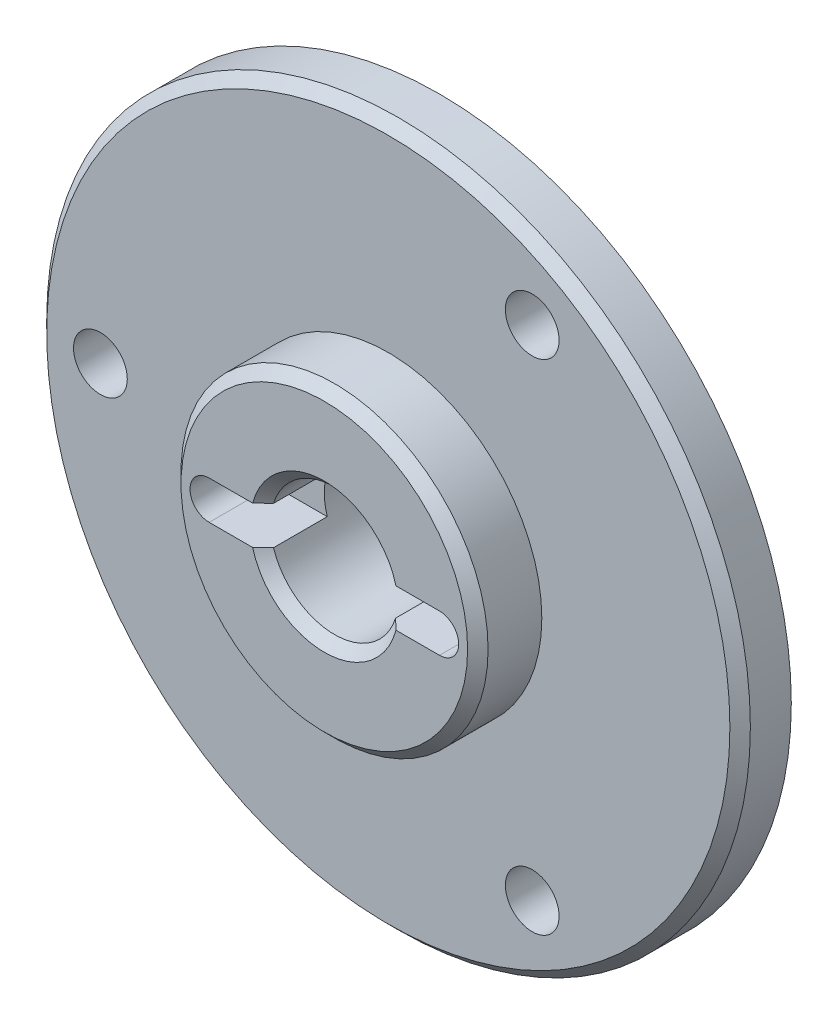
from build123d import *
from build123d.topology import SkipClean

# Parameters (mm, degrees)
SKETCH_1_R                   = 27.5
SKETCH_1_R_2                 = 5
EXTRUDE_1_DEPTH              = 4
EXTRUDE_START                = 12
SKETCH_2_R                   = 9.9
SKETCH_2_R_2                 = 5
EXTRUDE_2_DEPTH              = 12
SKETCH_3_R                   = 12
SKETCH_3_R_2                 = 5
EXTRUDE_3_DEPTH              = 5
CUT_EXTRUDE_1_DEPTH          = 5
HOLE_WIZARD_M5_2_D           = 4.2
HOLE_WIZARD_M5_2_CSINK_D     = 5.3
HOLE_WIZARD_M5_2_CSINK_ANGLE = 90
SKETCH_8_R                   = 2.4
EXTRUDE_4_DEPTH              = 2.5
CHAMFER_1_SIZE               = 0.8


with BuildPart() as part:
    # Sketch 1 → Extrude 1 (new body)
    with BuildSketch(Plane.XY):
        Circle(SKETCH_1_R)
        Circle(SKETCH_1_R_2, mode=Mode.SUBTRACT)
    extrude(amount=EXTRUDE_1_DEPTH)

    # Sketch 2 → Extrude 2 (add)
    with SkipClean():  # the faces are left unmerged after this step: merging them gives an invalid solid
        with BuildSketch(Plane(origin=(0, 0, 0), x_dir=(-1, 0, 0), z_dir=(0, 0, -1)).offset(EXTRUDE_START)):
            with Locations(Location((0, 0, 0), (0, 0, 180))):
                Circle(SKETCH_2_R)
            Circle(SKETCH_2_R_2, mode=Mode.SUBTRACT)
        extrude(amount=-EXTRUDE_2_DEPTH)

    # Sketch 3 → Extrude 3 (add)
    with BuildSketch(Plane.XY.offset(4)):
        Circle(SKETCH_3_R)
        with Locations(Location((0, 0, 0), (0, 0, 180))):
            Circle(SKETCH_3_R_2, mode=Mode.SUBTRACT)
    extrude(amount=EXTRUDE_3_DEPTH)

    # Sketch 4 → Cut-Extrude 1 (cut)
    with BuildSketch(Plane.XY.offset(9)):
        with BuildLine():
            Line((-9, 1.5), (9, 1.5))
            ThreePointArc((9, 1.5), (10.5, 0), (9, -1.5))
            Line((9, -1.5), (-9, -1.5))
            ThreePointArc((-9, -1.5), (-10.5, 0), (-9, 1.5))
        make_face()
    extrude(amount=-CUT_EXTRUDE_1_DEPTH, mode=Mode.SUBTRACT)

    # Hole Wizard M5 _2 (through all)
    with Locations(Plane(origin=(11.25, 19.485571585, 0), x_dir=(-1, 0, 0), z_dir=(0, 0, -1))):
        with Locations((0, 0), (33.75, -19.485571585), (0, -38.97114317)):
            CounterSinkHole(HOLE_WIZARD_M5_2_D / 2, HOLE_WIZARD_M5_2_CSINK_D / 2, counter_sink_angle=HOLE_WIZARD_M5_2_CSINK_ANGLE)

    # Sketch 8 → Extrude 4 (add)
    with BuildSketch(Plane(origin=(0, 0, 0), x_dir=(-1, 0, 0), z_dir=(0, 0, -1))):
        with Locations(Location((11.25, 19.485571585, 0), (0, 0, 180))):
            Circle(SKETCH_8_R)
        with Locations(Location((-22.5, 0, 0), (0, 0, 180))):
            Circle(SKETCH_8_R)
        with Locations(Location((11.25, -19.485571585, 0), (0, 0, 180))):
            Circle(SKETCH_8_R)
    extrude(amount=EXTRUDE_4_DEPTH)

    # Chamfer 1
    chamfer_1_edges = [part.edges().sort_by_distance(p)[0] for p in [
        (-9.9, 0, -12),
        (-12, 0, 9),
        (0, 5, 9),
        (0, -5, 9),
        (-27.5, 0, 4),
        (-13.65, 19.485571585, -2.5),
        (20.1, 0, -2.5),
        (-13.65, -19.485571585, -2.5),
    ]]
    chamfer(chamfer_1_edges, length=CHAMFER_1_SIZE)


solid = part.part
